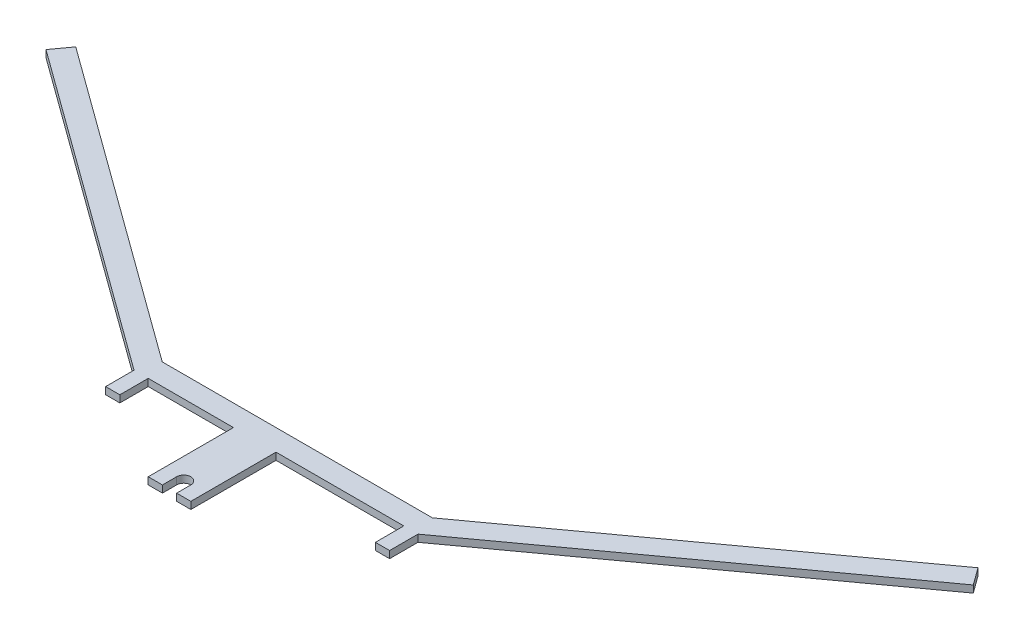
from build123d import *

# Parameters (mm, degrees)
EXTRUDE_1_DEPTH     = 0.25
SKETCH_2_W          = 1
SKETCH_2_H          = 2
EXTRUDE_2_DEPTH     = 0.5
SKETCH_5_W          = 4.537094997
SKETCH_5_H          = 4.32216947
CUT_EXTRUDE_1_DEPTH = 59.470879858
SKETCH_6_W          = 3
SKETCH_6_H          = 6
EXTRUDE_3_DEPTH     = 0.5
CUT_EXTRUDE_2_DEPTH = 62.829150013
SKETCH_8_W          = 1
SKETCH_8_H          = 2
EXTRUDE_4_DEPTH     = 0.5


with BuildPart() as part:
    # Sketch 1 → Extrude 1 (new, symmetric)
    with BuildSketch(Plane(origin=(0, 0, 0), x_dir=(1, 0, 0), z_dir=(0, 1, 0))):
        Polygon((-31.773422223, -28.831720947), (-9.512743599, -45), (9.512743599, -45), (31.773422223, -28.831720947), (32.654919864, -30.045377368), (10, -46.5), (-10, -46.5), (-32.654919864, -30.045377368), align=None)
    extrude(amount=EXTRUDE_1_DEPTH, both=True)

    # Sketch 2 → Extrude 2 (add)
    with BuildSketch(Plane(origin=(0, 0.25, 0), x_dir=(1, 0, 0), z_dir=(0, 1, 0))):
        with Locations((-9.5, -47.5)):
            Rectangle(SKETCH_2_W, SKETCH_2_H)
        with Locations((9.5, -47.5)):
            Rectangle(SKETCH_2_W, SKETCH_2_H)
    extrude(amount=-EXTRUDE_2_DEPTH)

    # Sketch 5 → Cut-Extrude 1 (cut, through all)
    with BuildSketch(Plane.XZ.offset(0.25)):
        with Locations((11.268547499, 48.661084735)):
            Rectangle(SKETCH_5_W, SKETCH_5_H)
    extrude(amount=-CUT_EXTRUDE_1_DEPTH, mode=Mode.SUBTRACT)

    # Sketch 6 → Extrude 3 (add)
    with BuildSketch(Plane.XZ.offset(0.25)):
        with Locations((-1.5, 49.5)):
            Rectangle(SKETCH_6_W, SKETCH_6_H)
    extrude(amount=-EXTRUDE_3_DEPTH)

    # Sketch 7 → Cut-Extrude 2 (cut, through all)
    with BuildSketch(Plane.XZ.offset(0.25)):
        with BuildLine():
            Line((-2, 51.5), (-2, 55.278413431))
            Line((-2, 55.278413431), (-1, 55.278413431))
            Line((-1, 55.278413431), (-1, 51.5))
            ThreePointArc((-1, 51.5), (-1.5, 51), (-2, 51.5))
        make_face()
    extrude(amount=-CUT_EXTRUDE_2_DEPTH, mode=Mode.SUBTRACT)

    # Sketch 8 → Extrude 4 (add)
    with BuildSketch(Plane.XZ.offset(0.25)):
        with Locations((9.5, 47.5)):
            Rectangle(SKETCH_8_W, SKETCH_8_H)
    extrude(amount=-EXTRUDE_4_DEPTH)


solid = part.part
